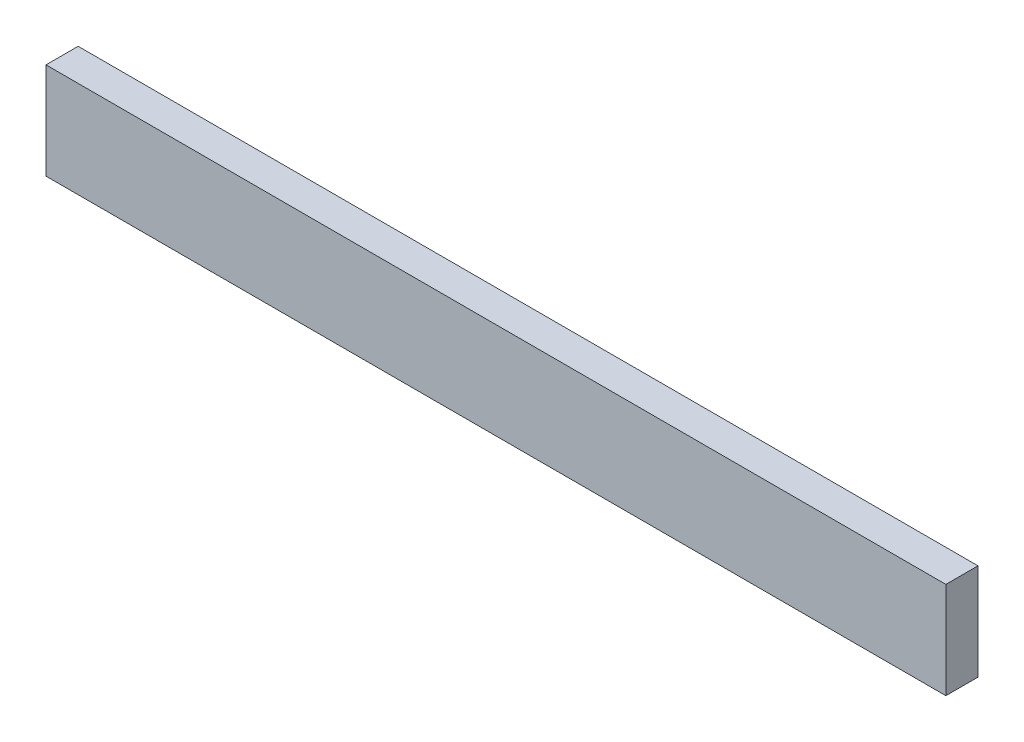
ISO-10303-21;
HEADER;
FILE_DESCRIPTION(('STEP AP214'),'2;1');
FILE_NAME('part.step','',(''),(''),'','','');
FILE_SCHEMA(('AUTOMOTIVE_DESIGN { 1 0 10303 214 1 1 1 1 }'));
ENDSEC;
DATA;
#1=APPLICATION_CONTEXT('core data for automotive mechanical design processes');
#2=APPLICATION_PROTOCOL_DEFINITION('international standard','automotive_design',2000,#1);
#3=PRODUCT_CONTEXT('',#1,'mechanical');
#4=PRODUCT('Part','Part','',(#3));
#5=PRODUCT_RELATED_PRODUCT_CATEGORY('part','',(#4));
#6=PRODUCT_DEFINITION_FORMATION('','',#4);
#7=PRODUCT_DEFINITION_CONTEXT('part definition',#1,'design');
#8=PRODUCT_DEFINITION('design','',#6,#7);
#9=PRODUCT_DEFINITION_SHAPE('','',#8);
#10=(LENGTH_UNIT() NAMED_UNIT(*) SI_UNIT(.MILLI.,.METRE.));
#11=(NAMED_UNIT(*) PLANE_ANGLE_UNIT() SI_UNIT($,.RADIAN.));
#12=(NAMED_UNIT(*) SI_UNIT($,.STERADIAN.) SOLID_ANGLE_UNIT());
#13=UNCERTAINTY_MEASURE_WITH_UNIT(LENGTH_MEASURE(1.E-05),#10,'distance_accuracy_value','');
#14=(GEOMETRIC_REPRESENTATION_CONTEXT(3) GLOBAL_UNCERTAINTY_ASSIGNED_CONTEXT((#13)) GLOBAL_UNIT_ASSIGNED_CONTEXT((#10,
#11,#12)) REPRESENTATION_CONTEXT('',''));
#15=CARTESIAN_POINT('',(0.,0.,0.));
#16=DIRECTION('',(0.,0.,1.));
#17=DIRECTION('',(1.,0.,0.));
#18=AXIS2_PLACEMENT_3D('',#15,#16,#17);
#19=CARTESIAN_POINT('',(-454.733765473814,38.1,-12.7));
#20=DIRECTION('',(0.,0.,-1.));
#21=DIRECTION('',(-1.,0.,0.));
#22=AXIS2_PLACEMENT_3D('',#19,#20,#21);
#23=PLANE('',#22);
#24=DIRECTION('',(1.,0.,0.));
#25=VECTOR('',#24,1.);
#26=CARTESIAN_POINT('',(-454.733765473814,0.,-12.7));
#27=LINE('',#26,#25);
#28=CARTESIAN_POINT('',(-355.6,0.,-12.7));
#29=VERTEX_POINT('',#28);
#30=CARTESIAN_POINT('',(0.,0.,-12.7));
#31=VERTEX_POINT('',#30);
#32=EDGE_CURVE('E97',#29,#31,#27,.T.);
#33=ORIENTED_EDGE('',*,*,#32,.F.);
#34=DIRECTION('',(0.,-1.,0.));
#35=VECTOR('',#34,1.);
#36=CARTESIAN_POINT('',(-355.6,38.1,-12.7));
#37=LINE('',#36,#35);
#38=CARTESIAN_POINT('',(-355.6,38.1,-12.7));
#39=VERTEX_POINT('',#38);
#40=EDGE_CURVE('E11',#39,#29,#37,.T.);
#41=ORIENTED_EDGE('',*,*,#40,.F.);
#42=DIRECTION('',(1.,0.,0.));
#43=VECTOR('',#42,1.);
#44=CARTESIAN_POINT('',(-454.733765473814,38.1,-12.7));
#45=LINE('',#44,#43);
#46=CARTESIAN_POINT('',(0.,38.1,-12.7));
#47=VERTEX_POINT('',#46);
#48=EDGE_CURVE('E90',#39,#47,#45,.T.);
#49=ORIENTED_EDGE('',*,*,#48,.T.);
#50=DIRECTION('',(0.,-1.,0.));
#51=VECTOR('',#50,1.);
#52=CARTESIAN_POINT('',(0.,38.1,-12.7));
#53=LINE('',#52,#51);
#54=EDGE_CURVE('E72',#47,#31,#53,.T.);
#55=ORIENTED_EDGE('',*,*,#54,.T.);
#56=EDGE_LOOP('',(#33,#41,#49,#55));
#57=FACE_BOUND('',#56,.T.);
#58=ADVANCED_FACE('F34',(#57),#23,.T.);
#59=CARTESIAN_POINT('',(-355.6,38.1,-6.35039294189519));
#60=DIRECTION('',(-1.,0.,0.));
#61=DIRECTION('',(0.,0.,1.));
#62=AXIS2_PLACEMENT_3D('',#59,#60,#61);
#63=PLANE('',#62);
#64=DIRECTION('',(0.,0.,-1.));
#65=VECTOR('',#64,1.);
#66=CARTESIAN_POINT('',(-355.6,0.,-6.35039294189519));
#67=LINE('',#66,#65);
#68=CARTESIAN_POINT('',(-355.6,0.,0.));
#69=VERTEX_POINT('',#68);
#70=EDGE_CURVE('E83',#69,#29,#67,.T.);
#71=ORIENTED_EDGE('',*,*,#70,.F.);
#72=DIRECTION('',(0.,-1.,0.));
#73=VECTOR('',#72,1.);
#74=CARTESIAN_POINT('',(-355.6,38.1,0.));
#75=LINE('',#74,#73);
#76=CARTESIAN_POINT('',(-355.6,38.1,0.));
#77=VERTEX_POINT('',#76);
#78=EDGE_CURVE('E42',#77,#69,#75,.T.);
#79=ORIENTED_EDGE('',*,*,#78,.F.);
#80=DIRECTION('',(0.,0.,-1.));
#81=VECTOR('',#80,1.);
#82=CARTESIAN_POINT('',(-355.6,38.1,-6.35039294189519));
#83=LINE('',#82,#81);
#84=EDGE_CURVE('E81',#77,#39,#83,.T.);
#85=ORIENTED_EDGE('',*,*,#84,.T.);
#86=ORIENTED_EDGE('',*,*,#40,.T.);
#87=EDGE_LOOP('',(#71,#79,#85,#86));
#88=FACE_BOUND('',#87,.T.);
#89=ADVANCED_FACE('F80',(#88),#63,.T.);
#90=CARTESIAN_POINT('',(-454.733765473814,38.1,0.));
#91=DIRECTION('',(0.,0.,1.));
#92=DIRECTION('',(1.,0.,0.));
#93=AXIS2_PLACEMENT_3D('',#90,#91,#92);
#94=PLANE('',#93);
#95=DIRECTION('',(-1.,0.,0.));
#96=VECTOR('',#95,1.);
#97=CARTESIAN_POINT('',(-454.733765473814,0.,0.));
#98=LINE('',#97,#96);
#99=CARTESIAN_POINT('',(0.,0.,0.));
#100=VERTEX_POINT('',#99);
#101=EDGE_CURVE('E101',#100,#69,#98,.T.);
#102=ORIENTED_EDGE('',*,*,#101,.F.);
#103=DIRECTION('',(0.,-1.,0.));
#104=VECTOR('',#103,1.);
#105=CARTESIAN_POINT('',(0.,38.1,0.));
#106=LINE('',#105,#104);
#107=CARTESIAN_POINT('',(0.,38.1,0.));
#108=VERTEX_POINT('',#107);
#109=EDGE_CURVE('E65',#108,#100,#106,.T.);
#110=ORIENTED_EDGE('',*,*,#109,.F.);
#111=DIRECTION('',(-1.,0.,0.));
#112=VECTOR('',#111,1.);
#113=CARTESIAN_POINT('',(-454.733765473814,38.1,0.));
#114=LINE('',#113,#112);
#115=EDGE_CURVE('E89',#108,#77,#114,.T.);
#116=ORIENTED_EDGE('',*,*,#115,.T.);
#117=ORIENTED_EDGE('',*,*,#78,.T.);
#118=EDGE_LOOP('',(#102,#110,#116,#117));
#119=FACE_BOUND('',#118,.T.);
#120=ADVANCED_FACE('F92',(#119),#94,.T.);
#121=CARTESIAN_POINT('',(0.,38.1,-6.35039294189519));
#122=DIRECTION('',(-1.,0.,0.));
#123=DIRECTION('',(0.,0.,1.));
#124=AXIS2_PLACEMENT_3D('',#121,#122,#123);
#125=PLANE('',#124);
#126=DIRECTION('',(0.,0.,-1.));
#127=VECTOR('',#126,1.);
#128=CARTESIAN_POINT('',(0.,0.,-6.35039294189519));
#129=LINE('',#128,#127);
#130=EDGE_CURVE('E103',#100,#31,#129,.T.);
#131=ORIENTED_EDGE('',*,*,#130,.T.);
#132=ORIENTED_EDGE('',*,*,#54,.F.);
#133=DIRECTION('',(0.,0.,-1.));
#134=VECTOR('',#133,1.);
#135=CARTESIAN_POINT('',(0.,38.1,-6.35039294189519));
#136=LINE('',#135,#134);
#137=EDGE_CURVE('E50',#108,#47,#136,.T.);
#138=ORIENTED_EDGE('',*,*,#137,.F.);
#139=ORIENTED_EDGE('',*,*,#109,.T.);
#140=EDGE_LOOP('',(#131,#132,#138,#139));
#141=FACE_BOUND('',#140,.T.);
#142=ADVANCED_FACE('F113',(#141),#125,.F.);
#143=CARTESIAN_POINT('',(-454.733765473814,38.1,-6.35039294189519));
#144=DIRECTION('',(0.,1.,0.));
#145=DIRECTION('',(0.,0.,1.));
#146=AXIS2_PLACEMENT_3D('',#143,#144,#145);
#147=PLANE('',#146);
#148=ORIENTED_EDGE('',*,*,#48,.F.);
#149=ORIENTED_EDGE('',*,*,#84,.F.);
#150=ORIENTED_EDGE('',*,*,#115,.F.);
#151=ORIENTED_EDGE('',*,*,#137,.T.);
#152=EDGE_LOOP('',(#148,#149,#150,#151));
#153=FACE_BOUND('',#152,.T.);
#154=ADVANCED_FACE('F88',(#153),#147,.T.);
#155=CARTESIAN_POINT('',(-454.733765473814,0.,-6.35039294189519));
#156=DIRECTION('',(0.,1.,0.));
#157=DIRECTION('',(0.,0.,1.));
#158=AXIS2_PLACEMENT_3D('',#155,#156,#157);
#159=PLANE('',#158);
#160=ORIENTED_EDGE('',*,*,#32,.T.);
#161=ORIENTED_EDGE('',*,*,#130,.F.);
#162=ORIENTED_EDGE('',*,*,#101,.T.);
#163=ORIENTED_EDGE('',*,*,#70,.T.);
#164=EDGE_LOOP('',(#160,#161,#162,#163));
#165=FACE_BOUND('',#164,.T.);
#166=ADVANCED_FACE('F118',(#165),#159,.F.);
#167=CLOSED_SHELL('',(#58,#89,#120,#142,#154,#166));
#168=MANIFOLD_SOLID_BREP('B2',#167);
#169=ADVANCED_BREP_SHAPE_REPRESENTATION('',(#18,#168),#14);
#170=SHAPE_DEFINITION_REPRESENTATION(#9,#169);
ENDSEC;
END-ISO-10303-21;
